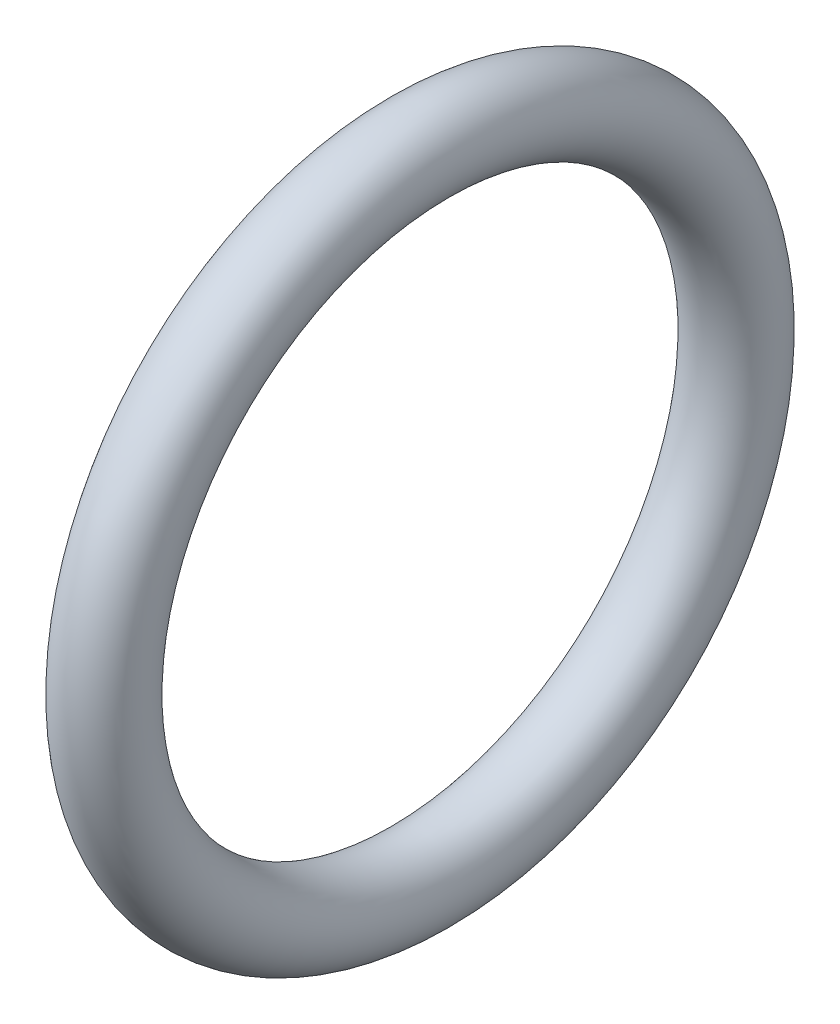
ISO-10303-21;
HEADER;
FILE_DESCRIPTION(('STEP AP214'),'2;1');
FILE_NAME('part.step','',(''),(''),'','','');
FILE_SCHEMA(('AUTOMOTIVE_DESIGN { 1 0 10303 214 1 1 1 1 }'));
ENDSEC;
DATA;
#1=APPLICATION_CONTEXT('core data for automotive mechanical design processes');
#2=APPLICATION_PROTOCOL_DEFINITION('international standard','automotive_design',2000,#1);
#3=PRODUCT_CONTEXT('',#1,'mechanical');
#4=PRODUCT('Part','Part','',(#3));
#5=PRODUCT_RELATED_PRODUCT_CATEGORY('part','',(#4));
#6=PRODUCT_DEFINITION_FORMATION('','',#4);
#7=PRODUCT_DEFINITION_CONTEXT('part definition',#1,'design');
#8=PRODUCT_DEFINITION('design','',#6,#7);
#9=PRODUCT_DEFINITION_SHAPE('','',#8);
#10=(LENGTH_UNIT() NAMED_UNIT(*) SI_UNIT(.MILLI.,.METRE.));
#11=(NAMED_UNIT(*) PLANE_ANGLE_UNIT() SI_UNIT($,.RADIAN.));
#12=(NAMED_UNIT(*) SI_UNIT($,.STERADIAN.) SOLID_ANGLE_UNIT());
#13=UNCERTAINTY_MEASURE_WITH_UNIT(LENGTH_MEASURE(1.E-05),#10,'distance_accuracy_value','');
#14=(GEOMETRIC_REPRESENTATION_CONTEXT(3) GLOBAL_UNCERTAINTY_ASSIGNED_CONTEXT((#13)) GLOBAL_UNIT_ASSIGNED_CONTEXT((#10,
#11,#12)) REPRESENTATION_CONTEXT('',''));
#15=CARTESIAN_POINT('',(0.,0.,0.));
#16=DIRECTION('',(0.,0.,1.));
#17=DIRECTION('',(1.,0.,0.));
#18=AXIS2_PLACEMENT_3D('',#15,#16,#17);
#19=CARTESIAN_POINT('',(6.5,0.,0.));
#20=DIRECTION('',(1.,0.,0.));
#21=DIRECTION('',(0.,-1.,0.));
#22=AXIS2_PLACEMENT_3D('',#19,#20,#21);
#23=TOROIDAL_SURFACE('',#22,25.,3.25);
#24=CARTESIAN_POINT('',(6.5,-28.25,0.));
#25=VERTEX_POINT('',#24);
#26=VERTEX_LOOP('',#25);
#27=FACE_BOUND('',#26,.T.);
#28=ADVANCED_FACE('F12',(#27),#23,.T.);
#29=CLOSED_SHELL('',(#28));
#30=MANIFOLD_SOLID_BREP('B1',#29);
#31=ADVANCED_BREP_SHAPE_REPRESENTATION('',(#18,#30),#14);
#32=SHAPE_DEFINITION_REPRESENTATION(#9,#31);
ENDSEC;
END-ISO-10303-21;
